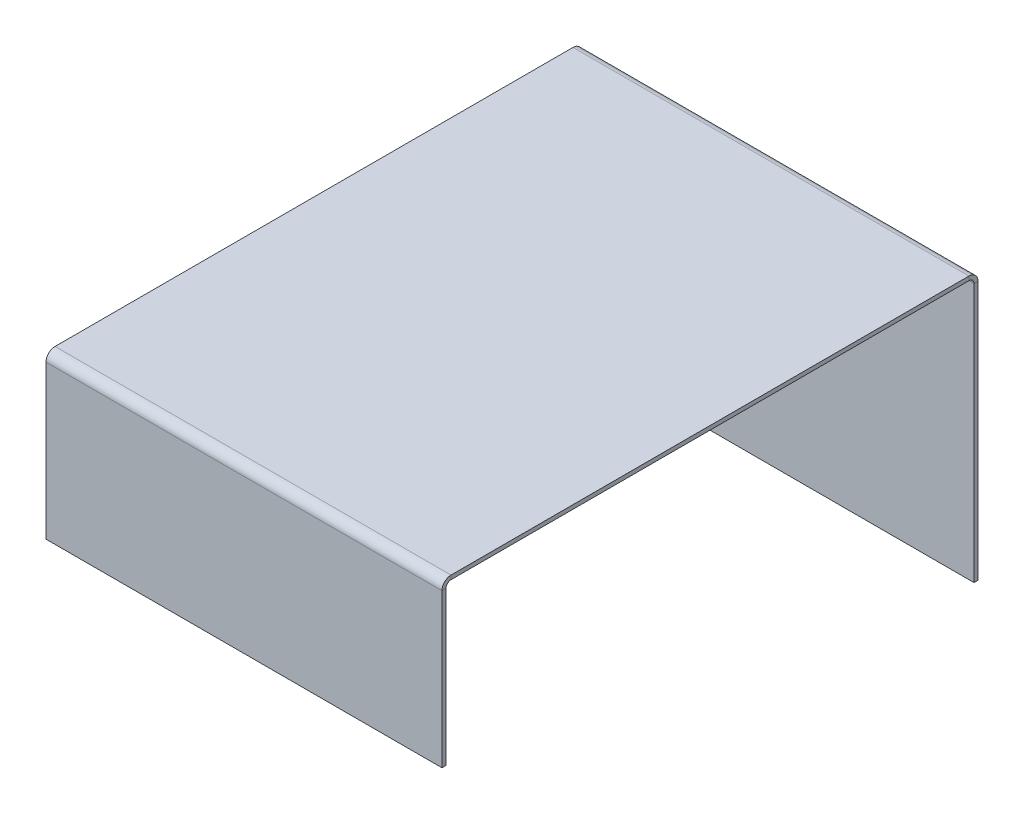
ISO-10303-21;
HEADER;
FILE_DESCRIPTION(('STEP AP214'),'2;1');
FILE_NAME('part.step','',(''),(''),'','','');
FILE_SCHEMA(('AUTOMOTIVE_DESIGN { 1 0 10303 214 1 1 1 1 }'));
ENDSEC;
DATA;
#1=APPLICATION_CONTEXT('core data for automotive mechanical design processes');
#2=APPLICATION_PROTOCOL_DEFINITION('international standard','automotive_design',2000,#1);
#3=PRODUCT_CONTEXT('',#1,'mechanical');
#4=PRODUCT('Part','Part','',(#3));
#5=PRODUCT_RELATED_PRODUCT_CATEGORY('part','',(#4));
#6=PRODUCT_DEFINITION_FORMATION('','',#4);
#7=PRODUCT_DEFINITION_CONTEXT('part definition',#1,'design');
#8=PRODUCT_DEFINITION('design','',#6,#7);
#9=PRODUCT_DEFINITION_SHAPE('','',#8);
#10=(LENGTH_UNIT() NAMED_UNIT(*) SI_UNIT(.MILLI.,.METRE.));
#11=(NAMED_UNIT(*) PLANE_ANGLE_UNIT() SI_UNIT($,.RADIAN.));
#12=(NAMED_UNIT(*) SI_UNIT($,.STERADIAN.) SOLID_ANGLE_UNIT());
#13=UNCERTAINTY_MEASURE_WITH_UNIT(LENGTH_MEASURE(1.E-05),#10,'distance_accuracy_value','');
#14=(GEOMETRIC_REPRESENTATION_CONTEXT(3) GLOBAL_UNCERTAINTY_ASSIGNED_CONTEXT((#13)) GLOBAL_UNIT_ASSIGNED_CONTEXT((#10,
#11,#12)) REPRESENTATION_CONTEXT('',''));
#15=CARTESIAN_POINT('',(0.,0.,0.));
#16=DIRECTION('',(0.,0.,1.));
#17=DIRECTION('',(1.,0.,0.));
#18=AXIS2_PLACEMENT_3D('',#15,#16,#17);
#19=CARTESIAN_POINT('',(150.,50.,-98.095));
#20=DIRECTION('',(1.,0.,0.));
#21=DIRECTION('',(0.,0.,-1.));
#22=AXIS2_PLACEMENT_3D('',#19,#20,#21);
#23=PLANE('',#22);
#24=DIRECTION('',(0.,1.,0.));
#25=VECTOR('',#24,1.);
#26=CARTESIAN_POINT('',(150.,50.,-98.095));
#27=LINE('',#26,#25);
#28=CARTESIAN_POINT('',(150.,50.,-98.095));
#29=VERTEX_POINT('',#28);
#30=CARTESIAN_POINT('',(150.,51.51892,-98.095));
#31=VERTEX_POINT('',#30);
#32=EDGE_CURVE('E11',#29,#31,#27,.T.);
#33=ORIENTED_EDGE('',*,*,#32,.F.);
#34=CARTESIAN_POINT('',(150.,48.095,-98.095));
#35=DIRECTION('',(-1.,0.,0.));
#36=DIRECTION('',(0.,0.,1.));
#37=AXIS2_PLACEMENT_3D('',#34,#35,#36);
#38=CIRCLE('',#37,1.905);
#39=CARTESIAN_POINT('',(150.,48.095,-100.));
#40=VERTEX_POINT('',#39);
#41=EDGE_CURVE('E248',#40,#29,#38,.F.);
#42=ORIENTED_EDGE('',*,*,#41,.F.);
#43=DIRECTION('',(0.,0.,1.));
#44=VECTOR('',#43,1.);
#45=CARTESIAN_POINT('',(150.,48.095,-101.51892));
#46=LINE('',#45,#44);
#47=CARTESIAN_POINT('',(150.,48.095,-101.51892));
#48=VERTEX_POINT('',#47);
#49=EDGE_CURVE('E46',#48,#40,#46,.T.);
#50=ORIENTED_EDGE('',*,*,#49,.F.);
#51=CARTESIAN_POINT('',(150.,48.095,-98.095));
#52=DIRECTION('',(1.,0.,0.));
#53=DIRECTION('',(0.,0.,-1.));
#54=AXIS2_PLACEMENT_3D('',#51,#52,#53);
#55=CIRCLE('',#54,3.42392);
#56=EDGE_CURVE('E147',#48,#31,#55,.T.);
#57=ORIENTED_EDGE('',*,*,#56,.T.);
#58=EDGE_LOOP('',(#33,#42,#50,#57));
#59=FACE_BOUND('',#58,.T.);
#60=ADVANCED_FACE('F38',(#59),#23,.T.);
#61=CARTESIAN_POINT('',(150.,48.095,-101.51892));
#62=DIRECTION('',(1.,0.,0.));
#63=DIRECTION('',(0.,0.,-1.));
#64=AXIS2_PLACEMENT_3D('',#61,#62,#63);
#65=PLANE('',#64);
#66=DIRECTION('',(0.,0.,1.));
#67=VECTOR('',#66,1.);
#68=CARTESIAN_POINT('',(150.,50.,100.));
#69=LINE('',#68,#67);
#70=CARTESIAN_POINT('',(150.,50.,98.095));
#71=VERTEX_POINT('',#70);
#72=EDGE_CURVE('E141',#29,#71,#69,.T.);
#73=ORIENTED_EDGE('',*,*,#72,.F.);
#74=ORIENTED_EDGE('',*,*,#32,.T.);
#75=DIRECTION('',(0.,0.,-1.));
#76=VECTOR('',#75,1.);
#77=CARTESIAN_POINT('',(150.,51.51892,100.));
#78=LINE('',#77,#76);
#79=CARTESIAN_POINT('',(150.,51.51892,98.095));
#80=VERTEX_POINT('',#79);
#81=EDGE_CURVE('E138',#31,#80,#78,.F.);
#82=ORIENTED_EDGE('',*,*,#81,.T.);
#83=DIRECTION('',(0.,-1.,0.));
#84=VECTOR('',#83,1.);
#85=CARTESIAN_POINT('',(150.,51.51892,98.095));
#86=LINE('',#85,#84);
#87=EDGE_CURVE('E229',#80,#71,#86,.T.);
#88=ORIENTED_EDGE('',*,*,#87,.T.);
#89=EDGE_LOOP('',(#73,#74,#82,#88));
#90=FACE_BOUND('',#89,.T.);
#91=ADVANCED_FACE('F136',(#90),#65,.T.);
#92=CARTESIAN_POINT('',(0.,48.095,-100.));
#93=DIRECTION('',(-1.,0.,0.));
#94=DIRECTION('',(0.,0.,1.));
#95=AXIS2_PLACEMENT_3D('',#92,#93,#94);
#96=PLANE('',#95);
#97=DIRECTION('',(0.,0.,-1.));
#98=VECTOR('',#97,1.);
#99=CARTESIAN_POINT('',(0.,48.095,-100.));
#100=LINE('',#99,#98);
#101=CARTESIAN_POINT('',(0.,48.095,-100.));
#102=VERTEX_POINT('',#101);
#103=CARTESIAN_POINT('',(0.,48.095,-101.51892));
#104=VERTEX_POINT('',#103);
#105=EDGE_CURVE('E234',#102,#104,#100,.T.);
#106=ORIENTED_EDGE('',*,*,#105,.F.);
#107=CARTESIAN_POINT('',(0.,48.095,-98.095));
#108=DIRECTION('',(-1.,0.,0.));
#109=DIRECTION('',(0.,0.,1.));
#110=AXIS2_PLACEMENT_3D('',#107,#108,#109);
#111=CIRCLE('',#110,1.905);
#112=CARTESIAN_POINT('',(0.,50.,-98.095));
#113=VERTEX_POINT('',#112);
#114=EDGE_CURVE('E186',#102,#113,#111,.F.);
#115=ORIENTED_EDGE('',*,*,#114,.T.);
#116=DIRECTION('',(0.,-1.,0.));
#117=VECTOR('',#116,1.);
#118=CARTESIAN_POINT('',(0.,51.51892,-98.095));
#119=LINE('',#118,#117);
#120=CARTESIAN_POINT('',(0.,51.51892,-98.095));
#121=VERTEX_POINT('',#120);
#122=EDGE_CURVE('E232',#121,#113,#119,.T.);
#123=ORIENTED_EDGE('',*,*,#122,.F.);
#124=CARTESIAN_POINT('',(0.,48.095,-98.095));
#125=DIRECTION('',(1.,0.,0.));
#126=DIRECTION('',(0.,0.,-1.));
#127=AXIS2_PLACEMENT_3D('',#124,#125,#126);
#128=CIRCLE('',#127,3.42392);
#129=EDGE_CURVE('E159',#104,#121,#128,.T.);
#130=ORIENTED_EDGE('',*,*,#129,.F.);
#131=EDGE_LOOP('',(#106,#115,#123,#130));
#132=FACE_BOUND('',#131,.T.);
#133=ADVANCED_FACE('F286',(#132),#96,.T.);
#134=CARTESIAN_POINT('',(0.,51.51892,-98.095));
#135=DIRECTION('',(-1.,0.,0.));
#136=DIRECTION('',(0.,0.,1.));
#137=AXIS2_PLACEMENT_3D('',#134,#135,#136);
#138=PLANE('',#137);
#139=DIRECTION('',(0.,1.,0.));
#140=VECTOR('',#139,1.);
#141=CARTESIAN_POINT('',(0.,50.,-100.));
#142=LINE('',#141,#140);
#143=CARTESIAN_POINT('',(0.,-50.,-100.));
#144=VERTEX_POINT('',#143);
#145=EDGE_CURVE('E189',#144,#102,#142,.T.);
#146=ORIENTED_EDGE('',*,*,#145,.T.);
#147=ORIENTED_EDGE('',*,*,#105,.T.);
#148=DIRECTION('',(0.,1.,0.));
#149=VECTOR('',#148,1.);
#150=CARTESIAN_POINT('',(0.,50.,-101.51892));
#151=LINE('',#150,#149);
#152=CARTESIAN_POINT('',(0.,-50.,-101.51892));
#153=VERTEX_POINT('',#152);
#154=EDGE_CURVE('E195',#153,#104,#151,.T.);
#155=ORIENTED_EDGE('',*,*,#154,.F.);
#156=DIRECTION('',(0.,0.,1.));
#157=VECTOR('',#156,1.);
#158=CARTESIAN_POINT('',(0.,-50.,-101.51892));
#159=LINE('',#158,#157);
#160=EDGE_CURVE('E192',#153,#144,#159,.T.);
#161=ORIENTED_EDGE('',*,*,#160,.T.);
#162=EDGE_LOOP('',(#146,#147,#155,#161));
#163=FACE_BOUND('',#162,.T.);
#164=ADVANCED_FACE('F289',(#163),#138,.T.);
#165=CARTESIAN_POINT('',(150.,48.095,100.));
#166=DIRECTION('',(1.,0.,0.));
#167=DIRECTION('',(0.,0.,-1.));
#168=AXIS2_PLACEMENT_3D('',#165,#166,#167);
#169=PLANE('',#168);
#170=DIRECTION('',(0.,0.,1.));
#171=VECTOR('',#170,1.);
#172=CARTESIAN_POINT('',(150.,48.095,100.));
#173=LINE('',#172,#171);
#174=CARTESIAN_POINT('',(150.,48.095,100.));
#175=VERTEX_POINT('',#174);
#176=CARTESIAN_POINT('',(150.,48.095,101.51892));
#177=VERTEX_POINT('',#176);
#178=EDGE_CURVE('E54',#175,#177,#173,.T.);
#179=ORIENTED_EDGE('',*,*,#178,.F.);
#180=CARTESIAN_POINT('',(150.,48.095,98.095));
#181=DIRECTION('',(-1.,0.,0.));
#182=DIRECTION('',(0.,0.,1.));
#183=AXIS2_PLACEMENT_3D('',#180,#181,#182);
#184=CIRCLE('',#183,1.905);
#185=EDGE_CURVE('E258',#71,#175,#184,.F.);
#186=ORIENTED_EDGE('',*,*,#185,.F.);
#187=ORIENTED_EDGE('',*,*,#87,.F.);
#188=CARTESIAN_POINT('',(150.,48.095,98.095));
#189=DIRECTION('',(1.,0.,0.));
#190=DIRECTION('',(0.,0.,-1.));
#191=AXIS2_PLACEMENT_3D('',#188,#189,#190);
#192=CIRCLE('',#191,3.42392);
#193=EDGE_CURVE('E167',#80,#177,#192,.T.);
#194=ORIENTED_EDGE('',*,*,#193,.T.);
#195=EDGE_LOOP('',(#179,#186,#187,#194));
#196=FACE_BOUND('',#195,.T.);
#197=ADVANCED_FACE('F281',(#196),#169,.T.);
#198=CARTESIAN_POINT('',(150.,51.51892,98.095));
#199=DIRECTION('',(1.,0.,0.));
#200=DIRECTION('',(0.,0.,-1.));
#201=AXIS2_PLACEMENT_3D('',#198,#199,#200);
#202=PLANE('',#201);
#203=DIRECTION('',(0.,-1.,0.));
#204=VECTOR('',#203,1.);
#205=CARTESIAN_POINT('',(150.,50.,100.));
#206=LINE('',#205,#204);
#207=CARTESIAN_POINT('',(150.,-9.99999999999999,100.));
#208=VERTEX_POINT('',#207);
#209=EDGE_CURVE('E261',#175,#208,#206,.T.);
#210=ORIENTED_EDGE('',*,*,#209,.F.);
#211=ORIENTED_EDGE('',*,*,#178,.T.);
#212=DIRECTION('',(0.,-1.,0.));
#213=VECTOR('',#212,1.);
#214=CARTESIAN_POINT('',(150.,50.,101.51892));
#215=LINE('',#214,#213);
#216=CARTESIAN_POINT('',(150.,-9.99999999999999,101.51892));
#217=VERTEX_POINT('',#216);
#218=EDGE_CURVE('E108',#177,#217,#215,.T.);
#219=ORIENTED_EDGE('',*,*,#218,.T.);
#220=DIRECTION('',(0.,0.,1.));
#221=VECTOR('',#220,1.);
#222=CARTESIAN_POINT('',(150.,-9.99999999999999,100.));
#223=LINE('',#222,#221);
#224=EDGE_CURVE('E264',#208,#217,#223,.T.);
#225=ORIENTED_EDGE('',*,*,#224,.F.);
#226=EDGE_LOOP('',(#210,#211,#219,#225));
#227=FACE_BOUND('',#226,.T.);
#228=ADVANCED_FACE('F270',(#227),#202,.T.);
#229=CARTESIAN_POINT('',(0.,50.,98.095));
#230=DIRECTION('',(-1.,0.,0.));
#231=DIRECTION('',(0.,0.,1.));
#232=AXIS2_PLACEMENT_3D('',#229,#230,#231);
#233=PLANE('',#232);
#234=DIRECTION('',(0.,1.,0.));
#235=VECTOR('',#234,1.);
#236=CARTESIAN_POINT('',(0.,50.,98.095));
#237=LINE('',#236,#235);
#238=CARTESIAN_POINT('',(0.,50.,98.095));
#239=VERTEX_POINT('',#238);
#240=CARTESIAN_POINT('',(0.,51.51892,98.095));
#241=VERTEX_POINT('',#240);
#242=EDGE_CURVE('E95',#239,#241,#237,.T.);
#243=ORIENTED_EDGE('',*,*,#242,.F.);
#244=CARTESIAN_POINT('',(0.,48.095,98.095));
#245=DIRECTION('',(-1.,0.,0.));
#246=DIRECTION('',(0.,0.,1.));
#247=AXIS2_PLACEMENT_3D('',#244,#245,#246);
#248=CIRCLE('',#247,1.905);
#249=CARTESIAN_POINT('',(0.,48.095,100.));
#250=VERTEX_POINT('',#249);
#251=EDGE_CURVE('E182',#239,#250,#248,.F.);
#252=ORIENTED_EDGE('',*,*,#251,.T.);
#253=DIRECTION('',(0.,0.,-1.));
#254=VECTOR('',#253,1.);
#255=CARTESIAN_POINT('',(0.,48.095,101.51892));
#256=LINE('',#255,#254);
#257=CARTESIAN_POINT('',(0.,48.095,101.51892));
#258=VERTEX_POINT('',#257);
#259=EDGE_CURVE('E102',#258,#250,#256,.T.);
#260=ORIENTED_EDGE('',*,*,#259,.F.);
#261=CARTESIAN_POINT('',(0.,48.095,98.095));
#262=DIRECTION('',(1.,0.,0.));
#263=DIRECTION('',(0.,0.,-1.));
#264=AXIS2_PLACEMENT_3D('',#261,#262,#263);
#265=CIRCLE('',#264,3.42392);
#266=EDGE_CURVE('E201',#241,#258,#265,.T.);
#267=ORIENTED_EDGE('',*,*,#266,.F.);
#268=EDGE_LOOP('',(#243,#252,#260,#267));
#269=FACE_BOUND('',#268,.T.);
#270=ADVANCED_FACE('F318',(#269),#233,.T.);
#271=CARTESIAN_POINT('',(0.,48.095,101.51892));
#272=DIRECTION('',(-1.,0.,0.));
#273=DIRECTION('',(0.,0.,1.));
#274=AXIS2_PLACEMENT_3D('',#271,#272,#273);
#275=PLANE('',#274);
#276=DIRECTION('',(0.,0.,1.));
#277=VECTOR('',#276,1.);
#278=CARTESIAN_POINT('',(0.,50.,100.));
#279=LINE('',#278,#277);
#280=EDGE_CURVE('E184',#113,#239,#279,.T.);
#281=ORIENTED_EDGE('',*,*,#280,.T.);
#282=ORIENTED_EDGE('',*,*,#242,.T.);
#283=DIRECTION('',(0.,0.,-1.));
#284=VECTOR('',#283,1.);
#285=CARTESIAN_POINT('',(0.,51.51892,100.));
#286=LINE('',#285,#284);
#287=EDGE_CURVE('E199',#121,#241,#286,.F.);
#288=ORIENTED_EDGE('',*,*,#287,.F.);
#289=ORIENTED_EDGE('',*,*,#122,.T.);
#290=EDGE_LOOP('',(#281,#282,#288,#289));
#291=FACE_BOUND('',#290,.T.);
#292=ADVANCED_FACE('F321',(#291),#275,.T.);
#293=CARTESIAN_POINT('',(150.,50.,101.51892));
#294=DIRECTION('',(0.,0.,-1.));
#295=DIRECTION('',(0.,1.,0.));
#296=AXIS2_PLACEMENT_3D('',#293,#294,#295);
#297=PLANE('',#296);
#298=DIRECTION('',(0.,-1.,0.));
#299=VECTOR('',#298,1.);
#300=CARTESIAN_POINT('',(0.,50.,101.51892));
#301=LINE('',#300,#299);
#302=CARTESIAN_POINT('',(0.,-9.99999999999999,101.51892));
#303=VERTEX_POINT('',#302);
#304=EDGE_CURVE('E173',#258,#303,#301,.T.);
#305=ORIENTED_EDGE('',*,*,#304,.T.);
#306=DIRECTION('',(-1.,0.,0.));
#307=VECTOR('',#306,1.);
#308=CARTESIAN_POINT('',(150.,-9.99999999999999,101.51892));
#309=LINE('',#308,#307);
#310=EDGE_CURVE('E225',#217,#303,#309,.T.);
#311=ORIENTED_EDGE('',*,*,#310,.F.);
#312=ORIENTED_EDGE('',*,*,#218,.F.);
#313=DIRECTION('',(-1.,0.,0.));
#314=VECTOR('',#313,1.);
#315=CARTESIAN_POINT('',(150.,48.095,101.51892));
#316=LINE('',#315,#314);
#317=EDGE_CURVE('E169',#177,#258,#316,.T.);
#318=ORIENTED_EDGE('',*,*,#317,.T.);
#319=EDGE_LOOP('',(#305,#311,#312,#318));
#320=FACE_BOUND('',#319,.T.);
#321=ADVANCED_FACE('F324',(#320),#297,.F.);
#322=CARTESIAN_POINT('',(150.,-9.99999999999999,100.));
#323=DIRECTION('',(0.,-1.,0.));
#324=DIRECTION('',(0.,0.,-1.));
#325=AXIS2_PLACEMENT_3D('',#322,#323,#324);
#326=PLANE('',#325);
#327=DIRECTION('',(0.,0.,1.));
#328=VECTOR('',#327,1.);
#329=CARTESIAN_POINT('',(0.,-9.99999999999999,100.));
#330=LINE('',#329,#328);
#331=CARTESIAN_POINT('',(0.,-9.99999999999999,100.));
#332=VERTEX_POINT('',#331);
#333=EDGE_CURVE('E176',#332,#303,#330,.T.);
#334=ORIENTED_EDGE('',*,*,#333,.F.);
#335=DIRECTION('',(-1.,0.,0.));
#336=VECTOR('',#335,1.);
#337=CARTESIAN_POINT('',(150.,-9.99999999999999,100.));
#338=LINE('',#337,#336);
#339=EDGE_CURVE('E223',#208,#332,#338,.T.);
#340=ORIENTED_EDGE('',*,*,#339,.F.);
#341=ORIENTED_EDGE('',*,*,#224,.T.);
#342=ORIENTED_EDGE('',*,*,#310,.T.);
#343=EDGE_LOOP('',(#334,#340,#341,#342));
#344=FACE_BOUND('',#343,.T.);
#345=ADVANCED_FACE('F269',(#344),#326,.T.);
#346=CARTESIAN_POINT('',(150.,50.,100.));
#347=DIRECTION('',(0.,0.,-1.));
#348=DIRECTION('',(0.,1.,0.));
#349=AXIS2_PLACEMENT_3D('',#346,#347,#348);
#350=PLANE('',#349);
#351=DIRECTION('',(0.,-1.,0.));
#352=VECTOR('',#351,1.);
#353=CARTESIAN_POINT('',(0.,50.,100.));
#354=LINE('',#353,#352);
#355=EDGE_CURVE('E179',#250,#332,#354,.T.);
#356=ORIENTED_EDGE('',*,*,#355,.F.);
#357=DIRECTION('',(-1.,0.,0.));
#358=VECTOR('',#357,1.);
#359=CARTESIAN_POINT('',(150.,48.095,100.));
#360=LINE('',#359,#358);
#361=EDGE_CURVE('E220',#175,#250,#360,.T.);
#362=ORIENTED_EDGE('',*,*,#361,.F.);
#363=ORIENTED_EDGE('',*,*,#209,.T.);
#364=ORIENTED_EDGE('',*,*,#339,.T.);
#365=EDGE_LOOP('',(#356,#362,#363,#364));
#366=FACE_BOUND('',#365,.T.);
#367=ADVANCED_FACE('F274',(#366),#350,.T.);
#368=CARTESIAN_POINT('',(150.,48.095,98.095));
#369=DIRECTION('',(-1.,0.,0.));
#370=DIRECTION('',(0.,0.,1.));
#371=AXIS2_PLACEMENT_3D('',#368,#369,#370);
#372=CYLINDRICAL_SURFACE('',#371,1.905);
#373=ORIENTED_EDGE('',*,*,#251,.F.);
#374=DIRECTION('',(-1.,0.,0.));
#375=VECTOR('',#374,1.);
#376=CARTESIAN_POINT('',(150.,50.,98.095));
#377=LINE('',#376,#375);
#378=EDGE_CURVE('E217',#71,#239,#377,.T.);
#379=ORIENTED_EDGE('',*,*,#378,.F.);
#380=ORIENTED_EDGE('',*,*,#185,.T.);
#381=ORIENTED_EDGE('',*,*,#361,.T.);
#382=EDGE_LOOP('',(#373,#379,#380,#381));
#383=FACE_BOUND('',#382,.T.);
#384=ADVANCED_FACE('F277',(#383),#372,.F.);
#385=CARTESIAN_POINT('',(150.,50.,100.));
#386=DIRECTION('',(0.,-1.,0.));
#387=DIRECTION('',(0.,0.,-1.));
#388=AXIS2_PLACEMENT_3D('',#385,#386,#387);
#389=PLANE('',#388);
#390=ORIENTED_EDGE('',*,*,#280,.F.);
#391=DIRECTION('',(-1.,0.,0.));
#392=VECTOR('',#391,1.);
#393=CARTESIAN_POINT('',(150.,50.,-98.095));
#394=LINE('',#393,#392);
#395=EDGE_CURVE('E214',#29,#113,#394,.T.);
#396=ORIENTED_EDGE('',*,*,#395,.F.);
#397=ORIENTED_EDGE('',*,*,#72,.T.);
#398=ORIENTED_EDGE('',*,*,#378,.T.);
#399=EDGE_LOOP('',(#390,#396,#397,#398));
#400=FACE_BOUND('',#399,.T.);
#401=ADVANCED_FACE('F284',(#400),#389,.T.);
#402=CARTESIAN_POINT('',(150.,48.095,-98.095));
#403=DIRECTION('',(-1.,0.,0.));
#404=DIRECTION('',(0.,0.,1.));
#405=AXIS2_PLACEMENT_3D('',#402,#403,#404);
#406=CYLINDRICAL_SURFACE('',#405,1.905);
#407=ORIENTED_EDGE('',*,*,#114,.F.);
#408=DIRECTION('',(-1.,0.,0.));
#409=VECTOR('',#408,1.);
#410=CARTESIAN_POINT('',(150.,48.095,-100.));
#411=LINE('',#410,#409);
#412=EDGE_CURVE('E211',#40,#102,#411,.T.);
#413=ORIENTED_EDGE('',*,*,#412,.F.);
#414=ORIENTED_EDGE('',*,*,#41,.T.);
#415=ORIENTED_EDGE('',*,*,#395,.T.);
#416=EDGE_LOOP('',(#407,#413,#414,#415));
#417=FACE_BOUND('',#416,.T.);
#418=ADVANCED_FACE('F247',(#417),#406,.F.);
#419=CARTESIAN_POINT('',(150.,50.,-100.));
#420=DIRECTION('',(0.,0.,1.));
#421=DIRECTION('',(0.,-1.,0.));
#422=AXIS2_PLACEMENT_3D('',#419,#420,#421);
#423=PLANE('',#422);
#424=ORIENTED_EDGE('',*,*,#145,.F.);
#425=DIRECTION('',(-1.,0.,0.));
#426=VECTOR('',#425,1.);
#427=CARTESIAN_POINT('',(150.,-50.,-100.));
#428=LINE('',#427,#426);
#429=CARTESIAN_POINT('',(150.,-50.,-100.));
#430=VERTEX_POINT('',#429);
#431=EDGE_CURVE('E209',#430,#144,#428,.T.);
#432=ORIENTED_EDGE('',*,*,#431,.F.);
#433=DIRECTION('',(0.,1.,0.));
#434=VECTOR('',#433,1.);
#435=CARTESIAN_POINT('',(150.,50.,-100.));
#436=LINE('',#435,#434);
#437=EDGE_CURVE('E241',#430,#40,#436,.T.);
#438=ORIENTED_EDGE('',*,*,#437,.T.);
#439=ORIENTED_EDGE('',*,*,#412,.T.);
#440=EDGE_LOOP('',(#424,#432,#438,#439));
#441=FACE_BOUND('',#440,.T.);
#442=ADVANCED_FACE('F252',(#441),#423,.T.);
#443=CARTESIAN_POINT('',(150.,-50.,-101.51892));
#444=DIRECTION('',(0.,-1.,0.));
#445=DIRECTION('',(0.,0.,-1.));
#446=AXIS2_PLACEMENT_3D('',#443,#444,#445);
#447=PLANE('',#446);
#448=ORIENTED_EDGE('',*,*,#160,.F.);
#449=DIRECTION('',(-1.,0.,0.));
#450=VECTOR('',#449,1.);
#451=CARTESIAN_POINT('',(150.,-50.,-101.51892));
#452=LINE('',#451,#450);
#453=CARTESIAN_POINT('',(150.,-50.,-101.51892));
#454=VERTEX_POINT('',#453);
#455=EDGE_CURVE('E207',#454,#153,#452,.T.);
#456=ORIENTED_EDGE('',*,*,#455,.F.);
#457=DIRECTION('',(0.,0.,1.));
#458=VECTOR('',#457,1.);
#459=CARTESIAN_POINT('',(150.,-50.,-101.51892));
#460=LINE('',#459,#458);
#461=EDGE_CURVE('E253',#454,#430,#460,.T.);
#462=ORIENTED_EDGE('',*,*,#461,.T.);
#463=ORIENTED_EDGE('',*,*,#431,.T.);
#464=EDGE_LOOP('',(#448,#456,#462,#463));
#465=FACE_BOUND('',#464,.T.);
#466=ADVANCED_FACE('F294',(#465),#447,.T.);
#467=CARTESIAN_POINT('',(150.,50.,-101.51892));
#468=DIRECTION('',(0.,0.,1.));
#469=DIRECTION('',(0.,-1.,0.));
#470=AXIS2_PLACEMENT_3D('',#467,#468,#469);
#471=PLANE('',#470);
#472=ORIENTED_EDGE('',*,*,#154,.T.);
#473=DIRECTION('',(-1.,0.,0.));
#474=VECTOR('',#473,1.);
#475=CARTESIAN_POINT('',(150.,48.095,-101.51892));
#476=LINE('',#475,#474);
#477=EDGE_CURVE('E161',#48,#104,#476,.T.);
#478=ORIENTED_EDGE('',*,*,#477,.F.);
#479=DIRECTION('',(0.,1.,0.));
#480=VECTOR('',#479,1.);
#481=CARTESIAN_POINT('',(150.,50.,-101.51892));
#482=LINE('',#481,#480);
#483=EDGE_CURVE('E152',#454,#48,#482,.T.);
#484=ORIENTED_EDGE('',*,*,#483,.F.);
#485=ORIENTED_EDGE('',*,*,#455,.T.);
#486=EDGE_LOOP('',(#472,#478,#484,#485));
#487=FACE_BOUND('',#486,.T.);
#488=ADVANCED_FACE('F292',(#487),#471,.F.);
#489=CARTESIAN_POINT('',(150.,48.095,-98.095));
#490=DIRECTION('',(-1.,0.,0.));
#491=DIRECTION('',(0.,0.,1.));
#492=AXIS2_PLACEMENT_3D('',#489,#490,#491);
#493=CYLINDRICAL_SURFACE('',#492,3.42392);
#494=ORIENTED_EDGE('',*,*,#129,.T.);
#495=DIRECTION('',(-1.,0.,0.));
#496=VECTOR('',#495,1.);
#497=CARTESIAN_POINT('',(150.,51.51892,-98.095));
#498=LINE('',#497,#496);
#499=EDGE_CURVE('E156',#31,#121,#498,.T.);
#500=ORIENTED_EDGE('',*,*,#499,.F.);
#501=ORIENTED_EDGE('',*,*,#56,.F.);
#502=ORIENTED_EDGE('',*,*,#477,.T.);
#503=EDGE_LOOP('',(#494,#500,#501,#502));
#504=FACE_BOUND('',#503,.T.);
#505=ADVANCED_FACE('F157',(#504),#493,.T.);
#506=CARTESIAN_POINT('',(150.,51.51892,100.));
#507=DIRECTION('',(0.,-1.,0.));
#508=DIRECTION('',(0.,0.,-1.));
#509=AXIS2_PLACEMENT_3D('',#506,#507,#508);
#510=PLANE('',#509);
#511=ORIENTED_EDGE('',*,*,#287,.T.);
#512=DIRECTION('',(-1.,0.,0.));
#513=VECTOR('',#512,1.);
#514=CARTESIAN_POINT('',(150.,51.51892,98.095));
#515=LINE('',#514,#513);
#516=EDGE_CURVE('E162',#80,#241,#515,.T.);
#517=ORIENTED_EDGE('',*,*,#516,.F.);
#518=ORIENTED_EDGE('',*,*,#81,.F.);
#519=ORIENTED_EDGE('',*,*,#499,.T.);
#520=EDGE_LOOP('',(#511,#517,#518,#519));
#521=FACE_BOUND('',#520,.T.);
#522=ADVANCED_FACE('F164',(#521),#510,.F.);
#523=CARTESIAN_POINT('',(150.,48.095,98.095));
#524=DIRECTION('',(-1.,0.,0.));
#525=DIRECTION('',(0.,0.,1.));
#526=AXIS2_PLACEMENT_3D('',#523,#524,#525);
#527=CYLINDRICAL_SURFACE('',#526,3.42392);
#528=ORIENTED_EDGE('',*,*,#266,.T.);
#529=ORIENTED_EDGE('',*,*,#317,.F.);
#530=ORIENTED_EDGE('',*,*,#193,.F.);
#531=ORIENTED_EDGE('',*,*,#516,.T.);
#532=EDGE_LOOP('',(#528,#529,#530,#531));
#533=FACE_BOUND('',#532,.T.);
#534=ADVANCED_FACE('F376',(#533),#527,.T.);
#535=CARTESIAN_POINT('',(150.,48.095,98.095));
#536=DIRECTION('',(-1.,0.,0.));
#537=DIRECTION('',(0.,0.,1.));
#538=AXIS2_PLACEMENT_3D('',#535,#536,#537);
#539=PLANE('',#538);
#540=ORIENTED_EDGE('',*,*,#483,.T.);
#541=ORIENTED_EDGE('',*,*,#49,.T.);
#542=ORIENTED_EDGE('',*,*,#437,.F.);
#543=ORIENTED_EDGE('',*,*,#461,.F.);
#544=EDGE_LOOP('',(#540,#541,#542,#543));
#545=FACE_BOUND('',#544,.T.);
#546=ADVANCED_FACE('F238',(#545),#539,.F.);
#547=CARTESIAN_POINT('',(0.,48.095,98.095));
#548=DIRECTION('',(-1.,0.,0.));
#549=DIRECTION('',(0.,0.,1.));
#550=AXIS2_PLACEMENT_3D('',#547,#548,#549);
#551=PLANE('',#550);
#552=ORIENTED_EDGE('',*,*,#304,.F.);
#553=ORIENTED_EDGE('',*,*,#259,.T.);
#554=ORIENTED_EDGE('',*,*,#355,.T.);
#555=ORIENTED_EDGE('',*,*,#333,.T.);
#556=EDGE_LOOP('',(#552,#553,#554,#555));
#557=FACE_BOUND('',#556,.T.);
#558=ADVANCED_FACE('F396',(#557),#551,.T.);
#559=CLOSED_SHELL('',(#60,#91,#133,#164,#197,#228,#270,#292,#321,#345,#367,#384,#401,#418,#442,
#466,#488,#505,#522,#534,#546,#558));
#560=MANIFOLD_SOLID_BREP('B2',#559);
#561=ADVANCED_BREP_SHAPE_REPRESENTATION('',(#18,#560),#14);
#562=SHAPE_DEFINITION_REPRESENTATION(#9,#561);
ENDSEC;
END-ISO-10303-21;
